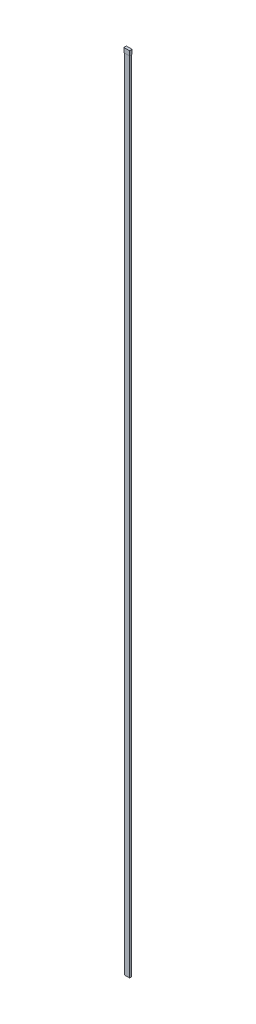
from build123d import *

# Parameters (mm, degrees)
SKETCH2_W           = 12.7
SKETCH2_H           = 1988.887499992
BOSS_EXTRUDE1_DEPTH = 2.38125
SKETCH1_W           = 14.2875
SKETCH1_H           = 11.1125
BOSS_EXTRUDE2_DEPTH = 3.175


with BuildPart() as part:
    # Sketch2 → Boss-Extrude1 (new, symmetric)
    with BuildSketch(Plane.XY):
        with Locations((0, -999.999999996)):
            Rectangle(SKETCH2_W, SKETCH2_H)
    extrude(amount=BOSS_EXTRUDE1_DEPTH, both=True)

    # Sketch1 → Boss-Extrude2 (add, symmetric)
    with BuildSketch(Plane.XY):
        Rectangle(SKETCH1_W, SKETCH1_H)
    extrude(amount=BOSS_EXTRUDE2_DEPTH, both=True)


solid = part.part
